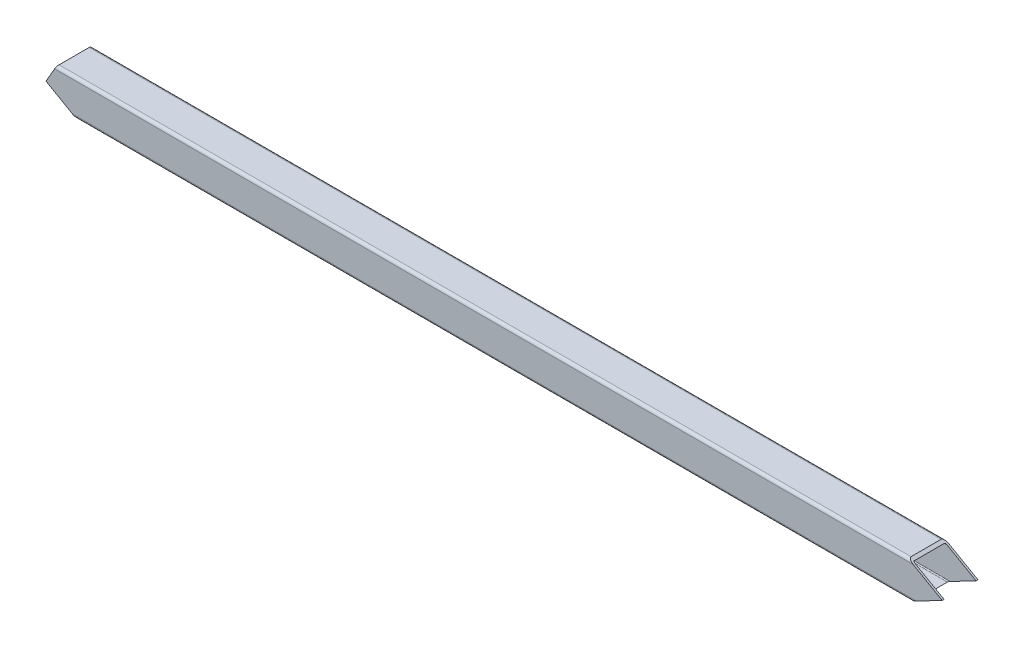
from build123d import *

# Parameters (mm, degrees)
BOSS_EXTRUDE1_DEPTH = 1016
CUT_EXTRUDE5_DEPTH  = 38.1
CUT_EXTRUDE6_DEPTH  = 38.1


with BuildPart() as part:
    # Sketch1 → Boss-Extrude1 (new body)
    with BuildSketch(Plane(origin=(0, 0, 0), x_dir=(0, 0, -1), z_dir=(1, 0, 0))):
        with BuildLine():
            Line((0, 2.54), (0, 29.21))
            ThreePointArc((0, 29.21), (-0.743948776, 31.006051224), (-2.54, 31.75))
            Line((-2.54, 31.75), (-29.21, 31.75))
            ThreePointArc((-29.21, 31.75), (-31.006051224, 31.006051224), (-31.75, 29.21))
            Line((-31.75, 29.21), (-31.75, 2.54))
            ThreePointArc((-31.75, 2.54), (-31.006051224, 0.743948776), (-29.21, 0))
            Line((-29.21, 0), (-2.54, 0))
            ThreePointArc((-2.54, 0), (-0.743948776, 0.743948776), (0, 2.54))
        make_face()
        with BuildLine():
            Line((-1.651, 2.54), (-1.651, 29.21))
            ThreePointArc((-1.651, 29.21), (-1.911382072, 29.838617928), (-2.54, 30.099))
            Line((-2.54, 30.099), (-29.21, 30.099))
            ThreePointArc((-29.21, 30.099), (-29.838617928, 29.838617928), (-30.099, 29.21))
            Line((-30.099, 29.21), (-30.099, 2.54))
            ThreePointArc((-30.099, 2.54), (-29.838617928, 1.911382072), (-29.21, 1.651))
            Line((-29.21, 1.651), (-2.54, 1.651))
            ThreePointArc((-2.54, 1.651), (-1.911382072, 1.911382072), (-1.651, 2.54))
        make_face(mode=Mode.SUBTRACT)
    extrude(amount=BOSS_EXTRUDE1_DEPTH)

    # Sketch4 → Cut-Extrude5 (cut)
    with BuildSketch(Plane.XY.offset(31.75)):
        Polygon((745.815003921, 42.729075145), (869.059671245, 258.126217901), (1152.329983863, 96.046280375), (991.382195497, -185.245352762), (698.961933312, -35.684273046), (729.947668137, -19.532845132), (795.192763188, 14.476399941), align=None)
    extrude(amount=-CUT_EXTRUDE5_DEPTH, mode=Mode.SUBTRACT)

    # Sketch5 → Cut-Extrude6 (cut)
    with BuildSketch(Plane.XY.offset(31.75)):
        Polygon((0, 15.875), (9.093639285, 31.75), (0, 36.959088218), (-17.405769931, 6.573387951), (26.973458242, -18.848261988), (34.706368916, -3.983085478), align=None)
    extrude(amount=-CUT_EXTRUDE6_DEPTH, mode=Mode.SUBTRACT)


solid = part.part
